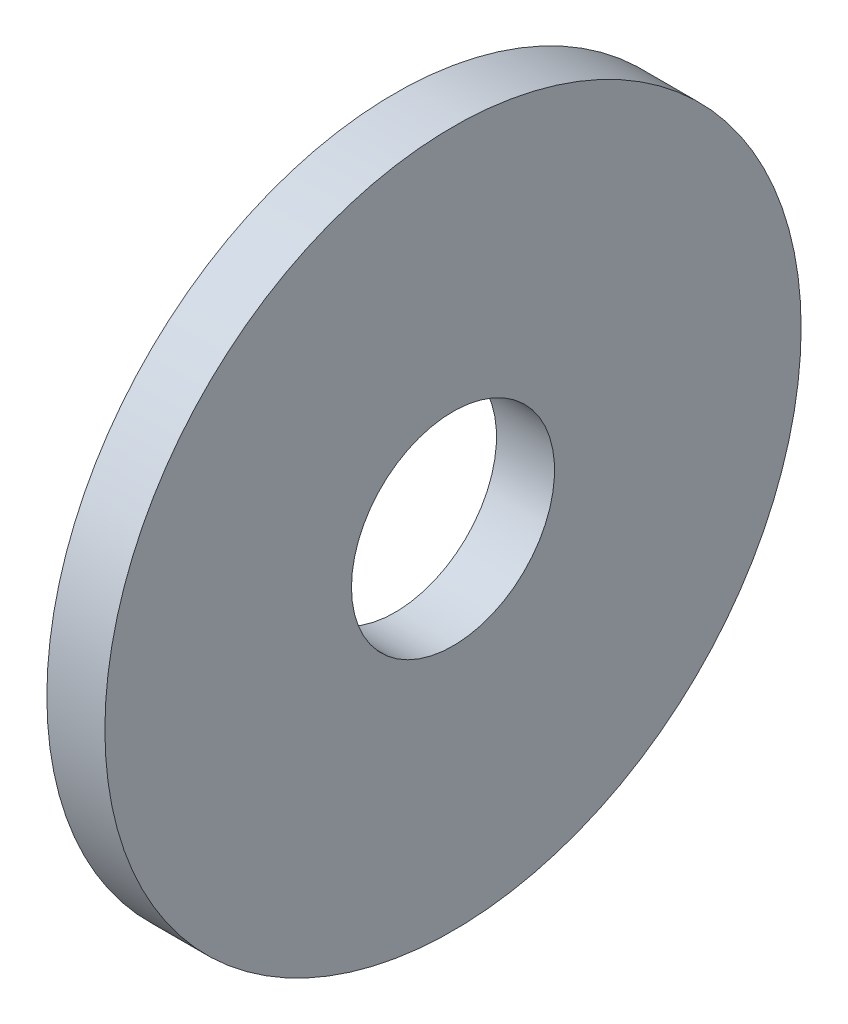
ISO-10303-21;
HEADER;
FILE_DESCRIPTION(('STEP AP214'),'2;1');
FILE_NAME('part.step','',(''),(''),'','','');
FILE_SCHEMA(('AUTOMOTIVE_DESIGN { 1 0 10303 214 1 1 1 1 }'));
ENDSEC;
DATA;
#1=APPLICATION_CONTEXT('core data for automotive mechanical design processes');
#2=APPLICATION_PROTOCOL_DEFINITION('international standard','automotive_design',2000,#1);
#3=PRODUCT_CONTEXT('',#1,'mechanical');
#4=PRODUCT('Part','Part','',(#3));
#5=PRODUCT_RELATED_PRODUCT_CATEGORY('part','',(#4));
#6=PRODUCT_DEFINITION_FORMATION('','',#4);
#7=PRODUCT_DEFINITION_CONTEXT('part definition',#1,'design');
#8=PRODUCT_DEFINITION('design','',#6,#7);
#9=PRODUCT_DEFINITION_SHAPE('','',#8);
#10=(LENGTH_UNIT() NAMED_UNIT(*) SI_UNIT(.MILLI.,.METRE.));
#11=(NAMED_UNIT(*) PLANE_ANGLE_UNIT() SI_UNIT($,.RADIAN.));
#12=(NAMED_UNIT(*) SI_UNIT($,.STERADIAN.) SOLID_ANGLE_UNIT());
#13=UNCERTAINTY_MEASURE_WITH_UNIT(LENGTH_MEASURE(1.E-05),#10,'distance_accuracy_value','');
#14=(GEOMETRIC_REPRESENTATION_CONTEXT(3) GLOBAL_UNCERTAINTY_ASSIGNED_CONTEXT((#13)) GLOBAL_UNIT_ASSIGNED_CONTEXT((#10,
#11,#12)) REPRESENTATION_CONTEXT('',''));
#15=CARTESIAN_POINT('',(0.,0.,0.));
#16=DIRECTION('',(0.,0.,1.));
#17=DIRECTION('',(1.,0.,0.));
#18=AXIS2_PLACEMENT_3D('',#15,#16,#17);
#19=CARTESIAN_POINT('',(0.,0.,-17.9999999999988));
#20=DIRECTION('',(1.,0.,0.));
#21=DIRECTION('',(0.,0.,-0.999999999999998));
#22=AXIS2_PLACEMENT_3D('',#19,#20,#21);
#23=PLANE('',#22);
#24=CARTESIAN_POINT('',(0.,0.,0.));
#25=DIRECTION('',(-1.,0.,0.));
#26=DIRECTION('',(0.,0.,0.999999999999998));
#27=AXIS2_PLACEMENT_3D('',#24,#25,#26);
#28=CIRCLE('',#27,5.25);
#29=CARTESIAN_POINT('',(0.,0.,5.24999999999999));
#30=VERTEX_POINT('',#29);
#31=EDGE_CURVE('E12',#30,#30,#28,.T.);
#32=ORIENTED_EDGE('',*,*,#31,.F.);
#33=EDGE_LOOP('',(#32));
#34=FACE_BOUND('',#33,.T.);
#35=CARTESIAN_POINT('',(0.,0.,0.));
#36=DIRECTION('',(-1.,0.,0.));
#37=DIRECTION('',(0.,0.,0.999999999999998));
#38=AXIS2_PLACEMENT_3D('',#35,#36,#37);
#39=CIRCLE('',#38,18.);
#40=CARTESIAN_POINT('',(0.,0.,18.));
#41=VERTEX_POINT('',#40);
#42=EDGE_CURVE('E51',#41,#41,#39,.T.);
#43=ORIENTED_EDGE('',*,*,#42,.T.);
#44=EDGE_LOOP('',(#43));
#45=FACE_BOUND('',#44,.T.);
#46=ADVANCED_FACE('F37',(#34,#45),#23,.F.);
#47=CARTESIAN_POINT('',(0.,0.,0.));
#48=DIRECTION('',(-1.,0.,0.));
#49=DIRECTION('',(0.,0.,0.999999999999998));
#50=AXIS2_PLACEMENT_3D('',#47,#48,#49);
#51=CYLINDRICAL_SURFACE('',#50,5.25);
#52=CARTESIAN_POINT('',(3.,0.,6.10622663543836E-13));
#53=DIRECTION('',(-1.,0.,0.));
#54=DIRECTION('',(0.,0.,0.999999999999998));
#55=AXIS2_PLACEMENT_3D('',#52,#53,#54);
#56=CIRCLE('',#55,5.25);
#57=CARTESIAN_POINT('',(3.,0.,5.2500000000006));
#58=VERTEX_POINT('',#57);
#59=EDGE_CURVE('E43',#58,#58,#56,.T.);
#60=ORIENTED_EDGE('',*,*,#59,.F.);
#61=EDGE_LOOP('',(#60));
#62=FACE_BOUND('',#61,.T.);
#63=ORIENTED_EDGE('',*,*,#31,.T.);
#64=EDGE_LOOP('',(#63));
#65=FACE_BOUND('',#64,.T.);
#66=ADVANCED_FACE('F66',(#62,#65),#51,.F.);
#67=CARTESIAN_POINT('',(3.,0.,-17.9999999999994));
#68=DIRECTION('',(-1.,0.,0.));
#69=DIRECTION('',(0.,0.,0.999999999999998));
#70=AXIS2_PLACEMENT_3D('',#67,#68,#69);
#71=PLANE('',#70);
#72=CARTESIAN_POINT('',(3.,0.,6.10622663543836E-13));
#73=DIRECTION('',(-1.,0.,0.));
#74=DIRECTION('',(0.,0.,0.999999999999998));
#75=AXIS2_PLACEMENT_3D('',#72,#73,#74);
#76=CIRCLE('',#75,18.);
#77=CARTESIAN_POINT('',(3.,0.,18.0000000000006));
#78=VERTEX_POINT('',#77);
#79=EDGE_CURVE('E47',#78,#78,#76,.T.);
#80=ORIENTED_EDGE('',*,*,#79,.F.);
#81=EDGE_LOOP('',(#80));
#82=FACE_BOUND('',#81,.T.);
#83=ORIENTED_EDGE('',*,*,#59,.T.);
#84=EDGE_LOOP('',(#83));
#85=FACE_BOUND('',#84,.T.);
#86=ADVANCED_FACE('F61',(#82,#85),#71,.F.);
#87=CARTESIAN_POINT('',(0.,0.,0.));
#88=DIRECTION('',(-1.,0.,0.));
#89=DIRECTION('',(0.,0.,0.999999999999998));
#90=AXIS2_PLACEMENT_3D('',#87,#88,#89);
#91=CYLINDRICAL_SURFACE('',#90,18.);
#92=ORIENTED_EDGE('',*,*,#42,.F.);
#93=EDGE_LOOP('',(#92));
#94=FACE_BOUND('',#93,.T.);
#95=ORIENTED_EDGE('',*,*,#79,.T.);
#96=EDGE_LOOP('',(#95));
#97=FACE_BOUND('',#96,.T.);
#98=ADVANCED_FACE('F58',(#94,#97),#91,.T.);
#99=CLOSED_SHELL('',(#46,#66,#86,#98));
#100=MANIFOLD_SOLID_BREP('B2',#99);
#101=ADVANCED_BREP_SHAPE_REPRESENTATION('',(#18,#100),#14);
#102=SHAPE_DEFINITION_REPRESENTATION(#9,#101);
ENDSEC;
END-ISO-10303-21;
